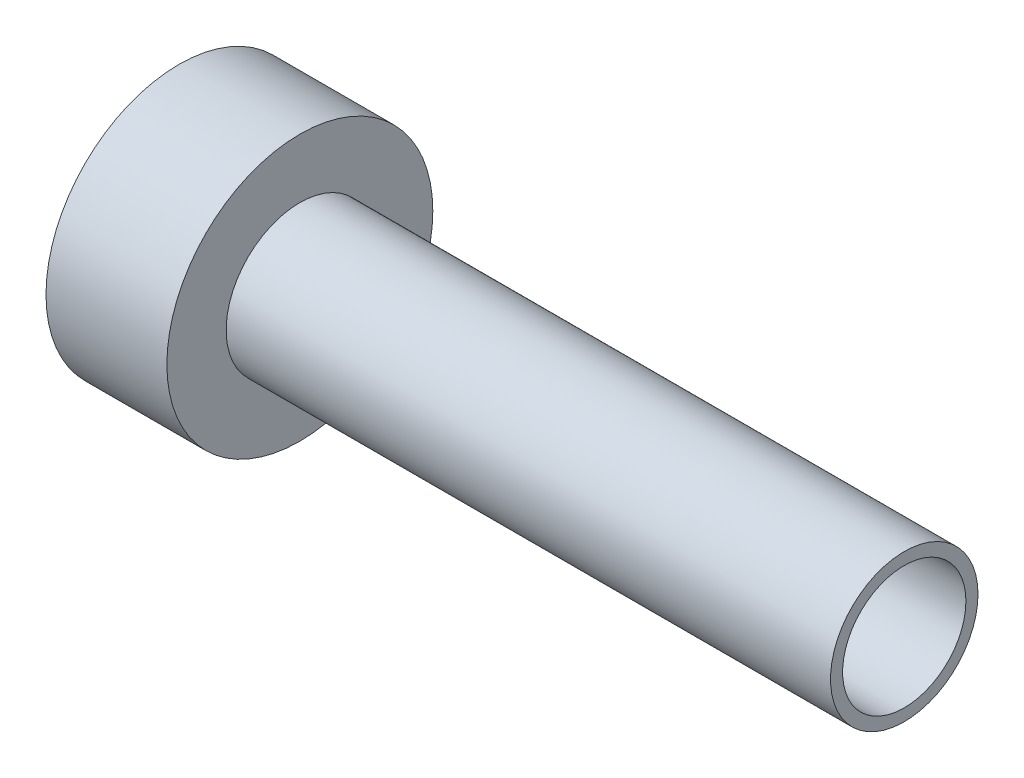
from build123d import *

# Parameters (mm, degrees)
CROQUIS1_R              = 55
CROQUIS1_R_2            = 25.5
SALIENTE_EXTRUIR1_DEPTH = 50
CROQUIS2_R              = 30.5
CROQUIS2_R_2            = 25.5
SALIENTE_EXTRUIR2_DEPTH = 250


with BuildPart() as part:
    # Croquis1 → Saliente-Extruir1 (new body)
    with BuildSketch(Plane(origin=(0, 0, 0), x_dir=(0, 0, -1), z_dir=(1, 0, 0))):
        Circle(CROQUIS1_R)
        Circle(CROQUIS1_R_2, mode=Mode.SUBTRACT)
    extrude(amount=SALIENTE_EXTRUIR1_DEPTH)

    # Croquis2 → Saliente-Extruir2 (add)
    with BuildSketch(Plane(origin=(50, 0, 0), x_dir=(0, 0, -1), z_dir=(1, 0, 0))):
        Circle(CROQUIS2_R)
        Circle(CROQUIS2_R_2, mode=Mode.SUBTRACT)
    extrude(amount=SALIENTE_EXTRUIR2_DEPTH)


solid = part.part
